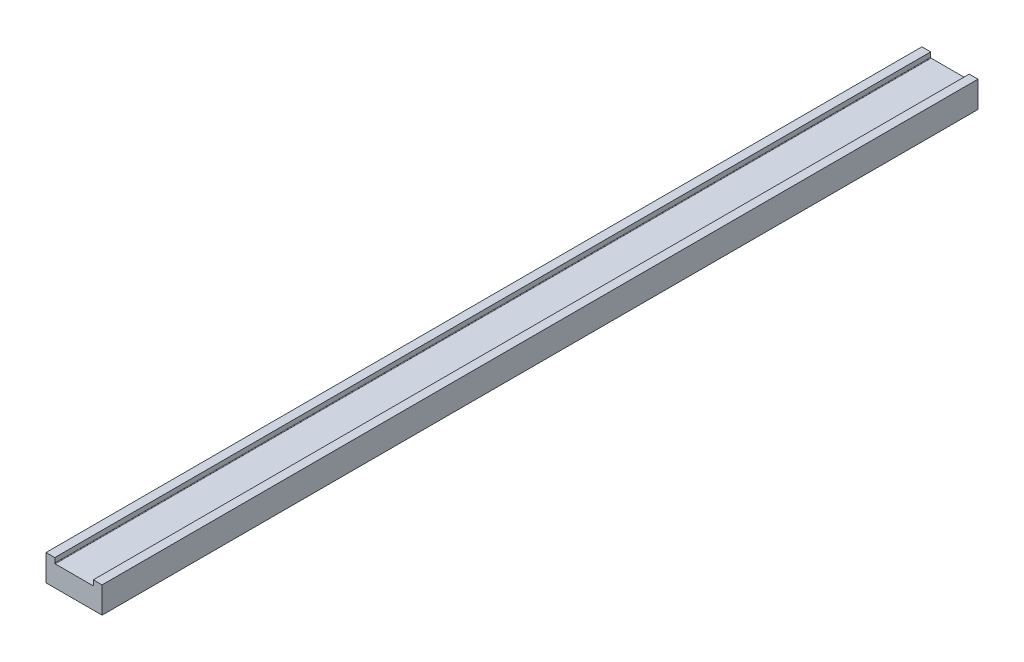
ISO-10303-21;
HEADER;
FILE_DESCRIPTION(('STEP AP214'),'2;1');
FILE_NAME('part.step','',(''),(''),'','','');
FILE_SCHEMA(('AUTOMOTIVE_DESIGN { 1 0 10303 214 1 1 1 1 }'));
ENDSEC;
DATA;
#1=APPLICATION_CONTEXT('core data for automotive mechanical design processes');
#2=APPLICATION_PROTOCOL_DEFINITION('international standard','automotive_design',2000,#1);
#3=PRODUCT_CONTEXT('',#1,'mechanical');
#4=PRODUCT('Part','Part','',(#3));
#5=PRODUCT_RELATED_PRODUCT_CATEGORY('part','',(#4));
#6=PRODUCT_DEFINITION_FORMATION('','',#4);
#7=PRODUCT_DEFINITION_CONTEXT('part definition',#1,'design');
#8=PRODUCT_DEFINITION('design','',#6,#7);
#9=PRODUCT_DEFINITION_SHAPE('','',#8);
#10=(LENGTH_UNIT() NAMED_UNIT(*) SI_UNIT(.MILLI.,.METRE.));
#11=(NAMED_UNIT(*) PLANE_ANGLE_UNIT() SI_UNIT($,.RADIAN.));
#12=(NAMED_UNIT(*) SI_UNIT($,.STERADIAN.) SOLID_ANGLE_UNIT());
#13=UNCERTAINTY_MEASURE_WITH_UNIT(LENGTH_MEASURE(1.E-05),#10,'distance_accuracy_value','');
#14=(GEOMETRIC_REPRESENTATION_CONTEXT(3) GLOBAL_UNCERTAINTY_ASSIGNED_CONTEXT((#13)) GLOBAL_UNIT_ASSIGNED_CONTEXT((#10,
#11,#12)) REPRESENTATION_CONTEXT('',''));
#15=CARTESIAN_POINT('',(0.,0.,0.));
#16=DIRECTION('',(0.,0.,1.));
#17=DIRECTION('',(1.,0.,0.));
#18=AXIS2_PLACEMENT_3D('',#15,#16,#17);
#19=CARTESIAN_POINT('',(-16.,15.,0.));
#20=DIRECTION('',(-1.,0.,0.));
#21=DIRECTION('',(0.,0.,1.));
#22=AXIS2_PLACEMENT_3D('',#19,#20,#21);
#23=PLANE('',#22);
#24=DIRECTION('',(0.,0.,1.));
#25=VECTOR('',#24,1.);
#26=CARTESIAN_POINT('',(-16.,15.,0.));
#27=LINE('',#26,#25);
#28=CARTESIAN_POINT('',(-16.,15.,0.));
#29=VERTEX_POINT('',#28);
#30=CARTESIAN_POINT('',(-16.,15.,500.));
#31=VERTEX_POINT('',#30);
#32=EDGE_CURVE('E9',#29,#31,#27,.T.);
#33=ORIENTED_EDGE('',*,*,#32,.F.);
#34=DIRECTION('',(0.,-1.,0.));
#35=VECTOR('',#34,1.);
#36=CARTESIAN_POINT('',(-16.,15.,0.));
#37=LINE('',#36,#35);
#38=CARTESIAN_POINT('',(-16.,0.,0.));
#39=VERTEX_POINT('',#38);
#40=EDGE_CURVE('E91',#29,#39,#37,.T.);
#41=ORIENTED_EDGE('',*,*,#40,.T.);
#42=DIRECTION('',(0.,0.,1.));
#43=VECTOR('',#42,1.);
#44=CARTESIAN_POINT('',(-16.,0.,0.));
#45=LINE('',#44,#43);
#46=CARTESIAN_POINT('',(-16.,0.,500.));
#47=VERTEX_POINT('',#46);
#48=EDGE_CURVE('E87',#39,#47,#45,.T.);
#49=ORIENTED_EDGE('',*,*,#48,.T.);
#50=DIRECTION('',(0.,-1.,0.));
#51=VECTOR('',#50,1.);
#52=CARTESIAN_POINT('',(-16.,15.,500.));
#53=LINE('',#52,#51);
#54=EDGE_CURVE('E89',#31,#47,#53,.T.);
#55=ORIENTED_EDGE('',*,*,#54,.F.);
#56=EDGE_LOOP('',(#33,#41,#49,#55));
#57=FACE_BOUND('',#56,.T.);
#58=ADVANCED_FACE('F14',(#57),#23,.T.);
#59=CARTESIAN_POINT('',(-16.,15.,0.));
#60=DIRECTION('',(0.,-1.,0.));
#61=DIRECTION('',(0.,0.,-1.));
#62=AXIS2_PLACEMENT_3D('',#59,#60,#61);
#63=PLANE('',#62);
#64=DIRECTION('',(0.,0.,1.));
#65=VECTOR('',#64,1.);
#66=CARTESIAN_POINT('',(-11.,15.,0.));
#67=LINE('',#66,#65);
#68=CARTESIAN_POINT('',(-11.,15.,0.));
#69=VERTEX_POINT('',#68);
#70=CARTESIAN_POINT('',(-11.,15.,500.));
#71=VERTEX_POINT('',#70);
#72=EDGE_CURVE('E22',#69,#71,#67,.T.);
#73=ORIENTED_EDGE('',*,*,#72,.F.);
#74=DIRECTION('',(1.,0.,0.));
#75=VECTOR('',#74,1.);
#76=CARTESIAN_POINT('',(-16.,15.,0.));
#77=LINE('',#76,#75);
#78=EDGE_CURVE('E97',#29,#69,#77,.T.);
#79=ORIENTED_EDGE('',*,*,#78,.F.);
#80=ORIENTED_EDGE('',*,*,#32,.T.);
#81=DIRECTION('',(1.,0.,0.));
#82=VECTOR('',#81,1.);
#83=CARTESIAN_POINT('',(-16.,15.,500.));
#84=LINE('',#83,#82);
#85=EDGE_CURVE('E106',#31,#71,#84,.T.);
#86=ORIENTED_EDGE('',*,*,#85,.T.);
#87=EDGE_LOOP('',(#73,#79,#80,#86));
#88=FACE_BOUND('',#87,.T.);
#89=ADVANCED_FACE('F16',(#88),#63,.F.);
#90=CARTESIAN_POINT('',(-11.,15.,0.));
#91=DIRECTION('',(-1.,0.,0.));
#92=DIRECTION('',(0.,-1.,0.));
#93=AXIS2_PLACEMENT_3D('',#90,#91,#92);
#94=PLANE('',#93);
#95=DIRECTION('',(0.,0.,1.));
#96=VECTOR('',#95,1.);
#97=CARTESIAN_POINT('',(-11.,12.3,0.));
#98=LINE('',#97,#96);
#99=CARTESIAN_POINT('',(-11.,12.3,0.));
#100=VERTEX_POINT('',#99);
#101=CARTESIAN_POINT('',(-11.,12.3,500.));
#102=VERTEX_POINT('',#101);
#103=EDGE_CURVE('E169',#100,#102,#98,.T.);
#104=ORIENTED_EDGE('',*,*,#103,.F.);
#105=DIRECTION('',(0.,-1.,0.));
#106=VECTOR('',#105,1.);
#107=CARTESIAN_POINT('',(-11.,15.,0.));
#108=LINE('',#107,#106);
#109=EDGE_CURVE('E153',#69,#100,#108,.T.);
#110=ORIENTED_EDGE('',*,*,#109,.F.);
#111=ORIENTED_EDGE('',*,*,#72,.T.);
#112=DIRECTION('',(0.,-1.,0.));
#113=VECTOR('',#112,1.);
#114=CARTESIAN_POINT('',(-11.,15.,500.));
#115=LINE('',#114,#113);
#116=EDGE_CURVE('E128',#71,#102,#115,.T.);
#117=ORIENTED_EDGE('',*,*,#116,.T.);
#118=EDGE_LOOP('',(#104,#110,#111,#117));
#119=FACE_BOUND('',#118,.T.);
#120=ADVANCED_FACE('F171',(#119),#94,.F.);
#121=CARTESIAN_POINT('',(-10.6999999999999,12.3,0.));
#122=DIRECTION('',(0.,0.,1.));
#123=DIRECTION('',(1.,0.,0.));
#124=AXIS2_PLACEMENT_3D('',#121,#122,#123);
#125=CYLINDRICAL_SURFACE('',#124,0.300000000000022);
#126=DIRECTION('',(0.,0.,1.));
#127=VECTOR('',#126,1.);
#128=CARTESIAN_POINT('',(-10.6999999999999,12.,0.));
#129=LINE('',#128,#127);
#130=CARTESIAN_POINT('',(-10.6999999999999,12.,0.));
#131=VERTEX_POINT('',#130);
#132=CARTESIAN_POINT('',(-10.6999999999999,12.,500.));
#133=VERTEX_POINT('',#132);
#134=EDGE_CURVE('E167',#131,#133,#129,.T.);
#135=ORIENTED_EDGE('',*,*,#134,.F.);
#136=CARTESIAN_POINT('',(-10.6999999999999,12.3,0.));
#137=DIRECTION('',(0.,0.,1.));
#138=DIRECTION('',(1.,0.,0.));
#139=AXIS2_PLACEMENT_3D('',#136,#137,#138);
#140=CIRCLE('',#139,0.300000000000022);
#141=EDGE_CURVE('E150',#100,#131,#140,.T.);
#142=ORIENTED_EDGE('',*,*,#141,.F.);
#143=ORIENTED_EDGE('',*,*,#103,.T.);
#144=CARTESIAN_POINT('',(-10.6999999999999,12.3,500.));
#145=DIRECTION('',(0.,0.,1.));
#146=DIRECTION('',(1.,0.,0.));
#147=AXIS2_PLACEMENT_3D('',#144,#145,#146);
#148=CIRCLE('',#147,0.300000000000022);
#149=EDGE_CURVE('E125',#102,#133,#148,.T.);
#150=ORIENTED_EDGE('',*,*,#149,.T.);
#151=EDGE_LOOP('',(#135,#142,#143,#150));
#152=FACE_BOUND('',#151,.T.);
#153=ADVANCED_FACE('F195',(#152),#125,.F.);
#154=CARTESIAN_POINT('',(-10.6999999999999,12.,0.));
#155=DIRECTION('',(0.,-1.,0.));
#156=DIRECTION('',(0.,0.,-1.));
#157=AXIS2_PLACEMENT_3D('',#154,#155,#156);
#158=PLANE('',#157);
#159=DIRECTION('',(0.,0.,1.));
#160=VECTOR('',#159,1.);
#161=CARTESIAN_POINT('',(10.7,12.,0.));
#162=LINE('',#161,#160);
#163=CARTESIAN_POINT('',(10.7,12.,0.));
#164=VERTEX_POINT('',#163);
#165=CARTESIAN_POINT('',(10.7,12.,500.));
#166=VERTEX_POINT('',#165);
#167=EDGE_CURVE('E165',#164,#166,#162,.T.);
#168=ORIENTED_EDGE('',*,*,#167,.F.);
#169=DIRECTION('',(1.,0.,0.));
#170=VECTOR('',#169,1.);
#171=CARTESIAN_POINT('',(-10.6999999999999,12.,0.));
#172=LINE('',#171,#170);
#173=EDGE_CURVE('E147',#131,#164,#172,.T.);
#174=ORIENTED_EDGE('',*,*,#173,.F.);
#175=ORIENTED_EDGE('',*,*,#134,.T.);
#176=DIRECTION('',(1.,0.,0.));
#177=VECTOR('',#176,1.);
#178=CARTESIAN_POINT('',(-10.6999999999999,12.,500.));
#179=LINE('',#178,#177);
#180=EDGE_CURVE('E122',#133,#166,#179,.T.);
#181=ORIENTED_EDGE('',*,*,#180,.T.);
#182=EDGE_LOOP('',(#168,#174,#175,#181));
#183=FACE_BOUND('',#182,.T.);
#184=ADVANCED_FACE('F193',(#183),#158,.F.);
#185=CARTESIAN_POINT('',(10.7,12.3,0.));
#186=DIRECTION('',(0.,0.,1.));
#187=DIRECTION('',(1.,0.,0.));
#188=AXIS2_PLACEMENT_3D('',#185,#186,#187);
#189=CYLINDRICAL_SURFACE('',#188,0.300000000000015);
#190=DIRECTION('',(0.,0.,1.));
#191=VECTOR('',#190,1.);
#192=CARTESIAN_POINT('',(11.,12.3,0.));
#193=LINE('',#192,#191);
#194=CARTESIAN_POINT('',(11.,12.3,0.));
#195=VERTEX_POINT('',#194);
#196=CARTESIAN_POINT('',(11.,12.3,500.));
#197=VERTEX_POINT('',#196);
#198=EDGE_CURVE('E163',#195,#197,#193,.T.);
#199=ORIENTED_EDGE('',*,*,#198,.F.);
#200=CARTESIAN_POINT('',(10.7,12.3,0.));
#201=DIRECTION('',(0.,0.,1.));
#202=DIRECTION('',(1.,0.,0.));
#203=AXIS2_PLACEMENT_3D('',#200,#201,#202);
#204=CIRCLE('',#203,0.300000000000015);
#205=EDGE_CURVE('E144',#164,#195,#204,.T.);
#206=ORIENTED_EDGE('',*,*,#205,.F.);
#207=ORIENTED_EDGE('',*,*,#167,.T.);
#208=CARTESIAN_POINT('',(10.7,12.3,500.));
#209=DIRECTION('',(0.,0.,1.));
#210=DIRECTION('',(1.,0.,0.));
#211=AXIS2_PLACEMENT_3D('',#208,#209,#210);
#212=CIRCLE('',#211,0.300000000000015);
#213=EDGE_CURVE('E119',#166,#197,#212,.T.);
#214=ORIENTED_EDGE('',*,*,#213,.T.);
#215=EDGE_LOOP('',(#199,#206,#207,#214));
#216=FACE_BOUND('',#215,.T.);
#217=ADVANCED_FACE('F189',(#216),#189,.F.);
#218=CARTESIAN_POINT('',(11.,15.,0.));
#219=DIRECTION('',(-1.,0.,0.));
#220=DIRECTION('',(0.,0.,1.));
#221=AXIS2_PLACEMENT_3D('',#218,#219,#220);
#222=PLANE('',#221);
#223=DIRECTION('',(0.,0.,1.));
#224=VECTOR('',#223,1.);
#225=CARTESIAN_POINT('',(11.,15.,0.));
#226=LINE('',#225,#224);
#227=CARTESIAN_POINT('',(11.,15.,0.));
#228=VERTEX_POINT('',#227);
#229=CARTESIAN_POINT('',(11.,15.,500.));
#230=VERTEX_POINT('',#229);
#231=EDGE_CURVE('E161',#228,#230,#226,.T.);
#232=ORIENTED_EDGE('',*,*,#231,.F.);
#233=DIRECTION('',(0.,-1.,0.));
#234=VECTOR('',#233,1.);
#235=CARTESIAN_POINT('',(11.,15.,0.));
#236=LINE('',#235,#234);
#237=EDGE_CURVE('E141',#228,#195,#236,.T.);
#238=ORIENTED_EDGE('',*,*,#237,.T.);
#239=ORIENTED_EDGE('',*,*,#198,.T.);
#240=DIRECTION('',(0.,-1.,0.));
#241=VECTOR('',#240,1.);
#242=CARTESIAN_POINT('',(11.,15.,500.));
#243=LINE('',#242,#241);
#244=EDGE_CURVE('E116',#230,#197,#243,.T.);
#245=ORIENTED_EDGE('',*,*,#244,.F.);
#246=EDGE_LOOP('',(#232,#238,#239,#245));
#247=FACE_BOUND('',#246,.T.);
#248=ADVANCED_FACE('F186',(#247),#222,.T.);
#249=CARTESIAN_POINT('',(11.,15.,0.));
#250=DIRECTION('',(0.,-1.,0.));
#251=DIRECTION('',(0.,0.,-1.));
#252=AXIS2_PLACEMENT_3D('',#249,#250,#251);
#253=PLANE('',#252);
#254=DIRECTION('',(0.,0.,1.));
#255=VECTOR('',#254,1.);
#256=CARTESIAN_POINT('',(16.,15.,0.));
#257=LINE('',#256,#255);
#258=CARTESIAN_POINT('',(16.,15.,0.));
#259=VERTEX_POINT('',#258);
#260=CARTESIAN_POINT('',(16.,15.,500.));
#261=VERTEX_POINT('',#260);
#262=EDGE_CURVE('E159',#259,#261,#257,.T.);
#263=ORIENTED_EDGE('',*,*,#262,.F.);
#264=DIRECTION('',(1.,0.,0.));
#265=VECTOR('',#264,1.);
#266=CARTESIAN_POINT('',(11.,15.,0.));
#267=LINE('',#266,#265);
#268=EDGE_CURVE('E138',#228,#259,#267,.T.);
#269=ORIENTED_EDGE('',*,*,#268,.F.);
#270=ORIENTED_EDGE('',*,*,#231,.T.);
#271=DIRECTION('',(1.,0.,0.));
#272=VECTOR('',#271,1.);
#273=CARTESIAN_POINT('',(11.,15.,500.));
#274=LINE('',#273,#272);
#275=EDGE_CURVE('E111',#230,#261,#274,.T.);
#276=ORIENTED_EDGE('',*,*,#275,.T.);
#277=EDGE_LOOP('',(#263,#269,#270,#276));
#278=FACE_BOUND('',#277,.T.);
#279=ADVANCED_FACE('F184',(#278),#253,.F.);
#280=CARTESIAN_POINT('',(16.,15.,0.));
#281=DIRECTION('',(-1.,0.,0.));
#282=DIRECTION('',(0.,0.,1.));
#283=AXIS2_PLACEMENT_3D('',#280,#281,#282);
#284=PLANE('',#283);
#285=DIRECTION('',(0.,0.,1.));
#286=VECTOR('',#285,1.);
#287=CARTESIAN_POINT('',(16.,0.,0.));
#288=LINE('',#287,#286);
#289=CARTESIAN_POINT('',(16.,0.,0.));
#290=VERTEX_POINT('',#289);
#291=CARTESIAN_POINT('',(16.,0.,500.));
#292=VERTEX_POINT('',#291);
#293=EDGE_CURVE('E96',#290,#292,#288,.T.);
#294=ORIENTED_EDGE('',*,*,#293,.F.);
#295=DIRECTION('',(0.,-1.,0.));
#296=VECTOR('',#295,1.);
#297=CARTESIAN_POINT('',(16.,15.,0.));
#298=LINE('',#297,#296);
#299=EDGE_CURVE('E135',#259,#290,#298,.T.);
#300=ORIENTED_EDGE('',*,*,#299,.F.);
#301=ORIENTED_EDGE('',*,*,#262,.T.);
#302=DIRECTION('',(0.,-1.,0.));
#303=VECTOR('',#302,1.);
#304=CARTESIAN_POINT('',(16.,15.,500.));
#305=LINE('',#304,#303);
#306=EDGE_CURVE('E109',#261,#292,#305,.T.);
#307=ORIENTED_EDGE('',*,*,#306,.T.);
#308=EDGE_LOOP('',(#294,#300,#301,#307));
#309=FACE_BOUND('',#308,.T.);
#310=ADVANCED_FACE('F180',(#309),#284,.F.);
#311=CARTESIAN_POINT('',(-16.,0.,0.));
#312=DIRECTION('',(0.,-1.,0.));
#313=DIRECTION('',(0.,0.,-1.));
#314=AXIS2_PLACEMENT_3D('',#311,#312,#313);
#315=PLANE('',#314);
#316=DIRECTION('',(1.,0.,0.));
#317=VECTOR('',#316,1.);
#318=CARTESIAN_POINT('',(-16.,0.,0.));
#319=LINE('',#318,#317);
#320=EDGE_CURVE('E133',#39,#290,#319,.T.);
#321=ORIENTED_EDGE('',*,*,#320,.T.);
#322=ORIENTED_EDGE('',*,*,#293,.T.);
#323=DIRECTION('',(1.,0.,0.));
#324=VECTOR('',#323,1.);
#325=CARTESIAN_POINT('',(-16.,0.,500.));
#326=LINE('',#325,#324);
#327=EDGE_CURVE('E103',#47,#292,#326,.T.);
#328=ORIENTED_EDGE('',*,*,#327,.F.);
#329=ORIENTED_EDGE('',*,*,#48,.F.);
#330=EDGE_LOOP('',(#321,#322,#328,#329));
#331=FACE_BOUND('',#330,.T.);
#332=ADVANCED_FACE('F108',(#331),#315,.T.);
#333=CARTESIAN_POINT('',(10.7,12.3,0.));
#334=DIRECTION('',(0.,0.,1.));
#335=DIRECTION('',(1.,0.,0.));
#336=AXIS2_PLACEMENT_3D('',#333,#334,#335);
#337=PLANE('',#336);
#338=ORIENTED_EDGE('',*,*,#40,.F.);
#339=ORIENTED_EDGE('',*,*,#78,.T.);
#340=ORIENTED_EDGE('',*,*,#109,.T.);
#341=ORIENTED_EDGE('',*,*,#141,.T.);
#342=ORIENTED_EDGE('',*,*,#173,.T.);
#343=ORIENTED_EDGE('',*,*,#205,.T.);
#344=ORIENTED_EDGE('',*,*,#237,.F.);
#345=ORIENTED_EDGE('',*,*,#268,.T.);
#346=ORIENTED_EDGE('',*,*,#299,.T.);
#347=ORIENTED_EDGE('',*,*,#320,.F.);
#348=EDGE_LOOP('',(#338,#339,#340,#341,#342,#343,#344,#345,#346,#347));
#349=FACE_BOUND('',#348,.T.);
#350=ADVANCED_FACE('F175',(#349),#337,.F.);
#351=CARTESIAN_POINT('',(10.7,12.3,500.));
#352=DIRECTION('',(0.,0.,1.));
#353=DIRECTION('',(1.,0.,0.));
#354=AXIS2_PLACEMENT_3D('',#351,#352,#353);
#355=PLANE('',#354);
#356=ORIENTED_EDGE('',*,*,#54,.T.);
#357=ORIENTED_EDGE('',*,*,#327,.T.);
#358=ORIENTED_EDGE('',*,*,#306,.F.);
#359=ORIENTED_EDGE('',*,*,#275,.F.);
#360=ORIENTED_EDGE('',*,*,#244,.T.);
#361=ORIENTED_EDGE('',*,*,#213,.F.);
#362=ORIENTED_EDGE('',*,*,#180,.F.);
#363=ORIENTED_EDGE('',*,*,#149,.F.);
#364=ORIENTED_EDGE('',*,*,#116,.F.);
#365=ORIENTED_EDGE('',*,*,#85,.F.);
#366=EDGE_LOOP('',(#356,#357,#358,#359,#360,#361,#362,#363,#364,#365));
#367=FACE_BOUND('',#366,.T.);
#368=ADVANCED_FACE('F101',(#367),#355,.T.);
#369=CLOSED_SHELL('',(#58,#89,#120,#153,#184,#217,#248,#279,#310,#332,#350,#368));
#370=MANIFOLD_SOLID_BREP('B1',#369);
#371=ADVANCED_BREP_SHAPE_REPRESENTATION('',(#18,#370),#14);
#372=SHAPE_DEFINITION_REPRESENTATION(#9,#371);
ENDSEC;
END-ISO-10303-21;
